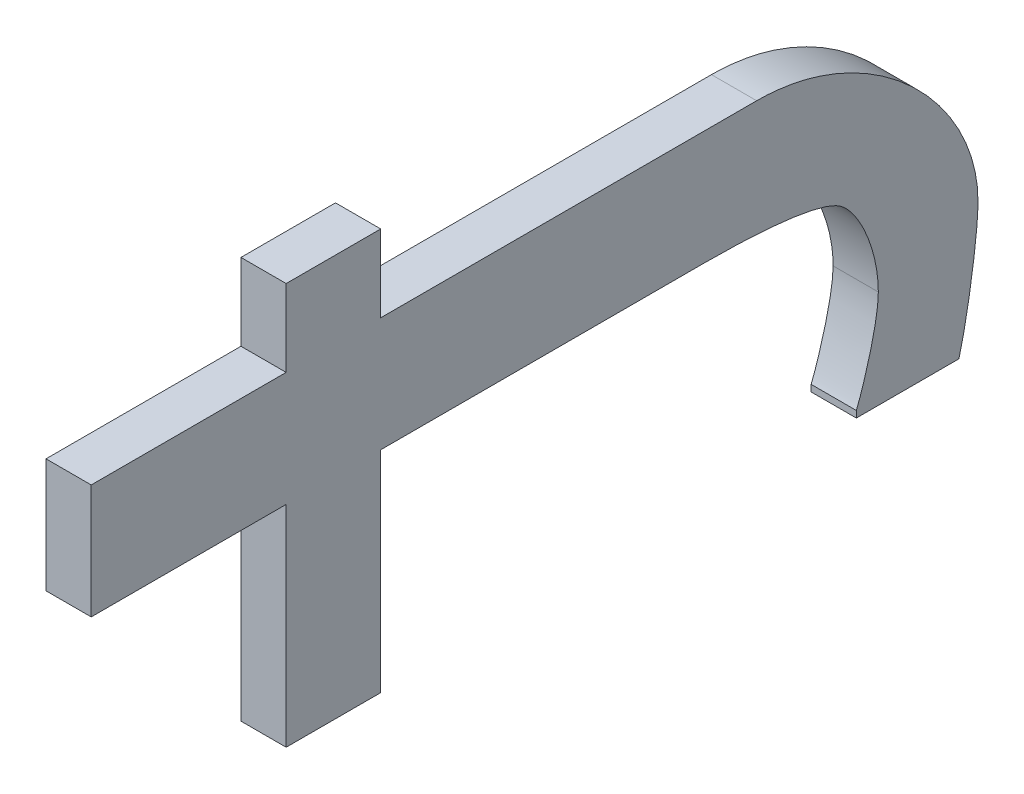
ISO-10303-21;
HEADER;
FILE_DESCRIPTION(('STEP AP214'),'2;1');
FILE_NAME('part.step','',(''),(''),'','','');
FILE_SCHEMA(('AUTOMOTIVE_DESIGN { 1 0 10303 214 1 1 1 1 }'));
ENDSEC;
DATA;
#1=APPLICATION_CONTEXT('core data for automotive mechanical design processes');
#2=APPLICATION_PROTOCOL_DEFINITION('international standard','automotive_design',2000,#1);
#3=PRODUCT_CONTEXT('',#1,'mechanical');
#4=PRODUCT('Part','Part','',(#3));
#5=PRODUCT_RELATED_PRODUCT_CATEGORY('part','',(#4));
#6=PRODUCT_DEFINITION_FORMATION('','',#4);
#7=PRODUCT_DEFINITION_CONTEXT('part definition',#1,'design');
#8=PRODUCT_DEFINITION('design','',#6,#7);
#9=PRODUCT_DEFINITION_SHAPE('','',#8);
#10=(LENGTH_UNIT() NAMED_UNIT(*) SI_UNIT(.MILLI.,.METRE.));
#11=(NAMED_UNIT(*) PLANE_ANGLE_UNIT() SI_UNIT($,.RADIAN.));
#12=(NAMED_UNIT(*) SI_UNIT($,.STERADIAN.) SOLID_ANGLE_UNIT());
#13=UNCERTAINTY_MEASURE_WITH_UNIT(LENGTH_MEASURE(1.E-05),#10,'distance_accuracy_value','');
#14=(GEOMETRIC_REPRESENTATION_CONTEXT(3) GLOBAL_UNCERTAINTY_ASSIGNED_CONTEXT((#13)) GLOBAL_UNIT_ASSIGNED_CONTEXT((#10,
#11,#12)) REPRESENTATION_CONTEXT('',''));
#15=CARTESIAN_POINT('',(0.,0.,0.));
#16=DIRECTION('',(0.,0.,1.));
#17=DIRECTION('',(1.,0.,0.));
#18=AXIS2_PLACEMENT_3D('',#15,#16,#17);
#19=CARTESIAN_POINT('',(-14.0348633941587,1.58473913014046,-0.050000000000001));
#20=DIRECTION('',(-1.,0.,0.));
#21=DIRECTION('',(0.,0.,1.));
#22=AXIS2_PLACEMENT_3D('',#19,#20,#21);
#23=PLANE('',#22);
#24=CARTESIAN_POINT('',(-14.0348633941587,1.95433767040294,-6.42248660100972));
#25=CARTESIAN_POINT('',(-14.0348633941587,1.97076863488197,-6.42248425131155));
#26=CARTESIAN_POINT('',(-14.0348633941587,1.98712230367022,-6.42099098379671));
#27=CARTESIAN_POINT('',(-14.0348633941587,2.01927458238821,-6.41549078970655));
#28=CARTESIAN_POINT('',(-14.0348633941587,2.035076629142,-6.41150444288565));
#29=CARTESIAN_POINT('',(-14.0348633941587,2.07290323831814,-6.39923257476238));
#30=CARTESIAN_POINT('',(-14.0348633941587,2.09455704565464,-6.38982231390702));
#31=CARTESIAN_POINT('',(-14.0348633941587,2.13618180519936,-6.36767421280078));
#32=CARTESIAN_POINT('',(-14.0348633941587,2.15614317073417,-6.35491890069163));
#33=CARTESIAN_POINT('',(-14.0348633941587,2.19990595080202,-6.32249859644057));
#34=CARTESIAN_POINT('',(-14.0348633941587,2.22302538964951,-6.30191232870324));
#35=CARTESIAN_POINT('',(-14.0348633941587,2.26559105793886,-6.25726301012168));
#36=CARTESIAN_POINT('',(-14.0348633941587,2.28503643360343,-6.23319915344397));
#37=CARTESIAN_POINT('',(-14.0348633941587,2.31992548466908,-6.18199243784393));
#38=CARTESIAN_POINT('',(-14.0348633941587,2.33533119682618,-6.15482359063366));
#39=CARTESIAN_POINT('',(-14.0348633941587,2.36109455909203,-6.09824915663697));
#40=CARTESIAN_POINT('',(-14.0348633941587,2.37146879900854,-6.06885129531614));
#41=CARTESIAN_POINT('',(-14.0348633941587,2.3873665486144,-6.00422144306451));
#42=CARTESIAN_POINT('',(-14.0348633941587,2.39196122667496,-5.96876413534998));
#43=CARTESIAN_POINT('',(-14.0348633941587,2.39193897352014,-5.93302143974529));
#44=B_SPLINE_CURVE_WITH_KNOTS('',3,(#24,#25,#26,#27,#28,#29,#30,#31,#32,#33,#34,#35,#36,#37,#38,
#39,#40,#41,#42,#43),.UNSPECIFIED.,.F.,.F.,(4,2,2,2,2,2,2,2,2,4),(0.,0.0491113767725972,
0.0978226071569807,0.168275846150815,0.239104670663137,0.33150468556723,0.423926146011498,
0.51718731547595,0.610138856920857,0.716655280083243),.UNSPECIFIED.);
#45=CARTESIAN_POINT('',(-14.0348633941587,1.95433767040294,-6.42248660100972));
#46=VERTEX_POINT('',#45);
#47=CARTESIAN_POINT('',(-14.0348633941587,2.3919389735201,-5.93302143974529));
#48=VERTEX_POINT('',#47);
#49=EDGE_CURVE('E382',#46,#48,#44,.T.);
#50=ORIENTED_EDGE('',*,*,#49,.T.);
#51=DIRECTION('',(0.,0.,-1.));
#52=VECTOR('',#51,1.);
#53=CARTESIAN_POINT('',(-14.0348633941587,2.39193897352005,-5.10157896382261));
#54=LINE('',#53,#52);
#55=CARTESIAN_POINT('',(-14.0348633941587,2.39193897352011,-5.10157896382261));
#56=VERTEX_POINT('',#55);
#57=EDGE_CURVE('E290',#48,#56,#54,.F.);
#58=ORIENTED_EDGE('',*,*,#57,.T.);
#59=DIRECTION('',(0.,1.,0.));
#60=VECTOR('',#59,1.);
#61=CARTESIAN_POINT('',(-14.0348633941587,2.56211725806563,-5.10157896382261));
#62=LINE('',#61,#60);
#63=CARTESIAN_POINT('',(-14.0348633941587,2.56211725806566,-5.10157896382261));
#64=VERTEX_POINT('',#63);
#65=EDGE_CURVE('E283',#56,#64,#62,.T.);
#66=ORIENTED_EDGE('',*,*,#65,.T.);
#67=DIRECTION('',(0.,0.,-1.));
#68=VECTOR('',#67,1.);
#69=CARTESIAN_POINT('',(-14.0348633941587,2.56211725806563,-4.89250278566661));
#70=LINE('',#69,#68);
#71=CARTESIAN_POINT('',(-14.0348633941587,2.56211725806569,-4.89250278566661));
#72=VERTEX_POINT('',#71);
#73=EDGE_CURVE('E269',#64,#72,#70,.F.);
#74=ORIENTED_EDGE('',*,*,#73,.T.);
#75=DIRECTION('',(0.,1.,0.));
#76=VECTOR('',#75,1.);
#77=CARTESIAN_POINT('',(-14.0348633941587,2.39193897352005,-4.89250278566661));
#78=LINE('',#77,#76);
#79=CARTESIAN_POINT('',(-14.0348633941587,2.39193897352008,-4.89250278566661));
#80=VERTEX_POINT('',#79);
#81=EDGE_CURVE('E255',#72,#80,#78,.F.);
#82=ORIENTED_EDGE('',*,*,#81,.T.);
#83=DIRECTION('',(0.,0.,-1.));
#84=VECTOR('',#83,1.);
#85=CARTESIAN_POINT('',(-14.0348633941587,2.39193897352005,-4.46138446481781));
#86=LINE('',#85,#84);
#87=CARTESIAN_POINT('',(-14.0348633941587,2.39193897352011,-4.46138446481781));
#88=VERTEX_POINT('',#87);
#89=EDGE_CURVE('E241',#80,#88,#86,.F.);
#90=ORIENTED_EDGE('',*,*,#89,.T.);
#91=DIRECTION('',(0.,1.,0.));
#92=VECTOR('',#91,1.);
#93=CARTESIAN_POINT('',(-14.0348633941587,2.13910266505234,-4.46138446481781));
#94=LINE('',#93,#92);
#95=CARTESIAN_POINT('',(-14.0348633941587,2.13910266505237,-4.46138446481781));
#96=VERTEX_POINT('',#95);
#97=EDGE_CURVE('E227',#88,#96,#94,.F.);
#98=ORIENTED_EDGE('',*,*,#97,.T.);
#99=DIRECTION('',(0.,0.,1.));
#100=VECTOR('',#99,1.);
#101=CARTESIAN_POINT('',(-14.0348633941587,2.13910266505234,-4.89250278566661));
#102=LINE('',#101,#100);
#103=CARTESIAN_POINT('',(-14.0348633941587,2.13910266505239,-4.89250278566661));
#104=VERTEX_POINT('',#103);
#105=EDGE_CURVE('E213',#96,#104,#102,.F.);
#106=ORIENTED_EDGE('',*,*,#105,.T.);
#107=DIRECTION('',(0.,1.,0.));
#108=VECTOR('',#107,1.);
#109=CARTESIAN_POINT('',(-14.0348633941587,1.67394868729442,-4.89250278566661));
#110=LINE('',#109,#108);
#111=CARTESIAN_POINT('',(-14.0348633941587,1.67394868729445,-4.89250278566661));
#112=VERTEX_POINT('',#111);
#113=EDGE_CURVE('E199',#104,#112,#110,.F.);
#114=ORIENTED_EDGE('',*,*,#113,.T.);
#115=DIRECTION('',(0.,0.,1.));
#116=VECTOR('',#115,1.);
#117=CARTESIAN_POINT('',(-14.0348633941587,1.67394868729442,-5.10157896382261));
#118=LINE('',#117,#116);
#119=CARTESIAN_POINT('',(-14.0348633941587,1.67394868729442,-5.10157896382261));
#120=VERTEX_POINT('',#119);
#121=EDGE_CURVE('E186',#112,#120,#118,.F.);
#122=ORIENTED_EDGE('',*,*,#121,.T.);
#123=DIRECTION('',(0.,1.,0.));
#124=VECTOR('',#123,1.);
#125=CARTESIAN_POINT('',(-14.0348633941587,2.13910266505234,-5.10157896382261));
#126=LINE('',#125,#124);
#127=CARTESIAN_POINT('',(-14.0348633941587,2.13910266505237,-5.10157896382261));
#128=VERTEX_POINT('',#127);
#129=EDGE_CURVE('E174',#120,#128,#126,.T.);
#130=ORIENTED_EDGE('',*,*,#129,.T.);
#131=DIRECTION('',(0.,0.,1.));
#132=VECTOR('',#131,1.);
#133=CARTESIAN_POINT('',(-14.0348633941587,2.13910266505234,-5.81632775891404));
#134=LINE('',#133,#132);
#135=CARTESIAN_POINT('',(-14.0348633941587,2.13910266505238,-5.81632775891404));
#136=VERTEX_POINT('',#135);
#137=EDGE_CURVE('E146',#128,#136,#134,.F.);
#138=ORIENTED_EDGE('',*,*,#137,.T.);
#139=CARTESIAN_POINT('',(-14.0348633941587,2.13910266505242,-5.81632775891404));
#140=CARTESIAN_POINT('',(-14.0348633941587,2.13909358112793,-5.83296080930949));
#141=CARTESIAN_POINT('',(-14.0348633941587,2.13892739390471,-5.84959658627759));
#142=CARTESIAN_POINT('',(-14.0348633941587,2.13818095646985,-5.88293502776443));
#143=CARTESIAN_POINT('',(-14.0348633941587,2.13759880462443,-5.89963764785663));
#144=CARTESIAN_POINT('',(-14.0348633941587,2.13594774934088,-5.93244352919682));
#145=CARTESIAN_POINT('',(-14.0348633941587,2.1348962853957,-5.94854763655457));
#146=CARTESIAN_POINT('',(-14.0348633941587,2.13214075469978,-5.98065862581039));
#147=CARTESIAN_POINT('',(-14.0348633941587,2.13043857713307,-5.9966656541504));
#148=CARTESIAN_POINT('',(-14.0348633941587,2.12709835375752,-6.02074604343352));
#149=CARTESIAN_POINT('',(-14.0348633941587,2.12583613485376,-6.02887057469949));
#150=CARTESIAN_POINT('',(-14.0348633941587,2.12295200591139,-6.04504517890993));
#151=CARTESIAN_POINT('',(-14.0348633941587,2.12133059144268,-6.05309533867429));
#152=CARTESIAN_POINT('',(-14.0348633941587,2.11756071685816,-6.06913687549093));
#153=CARTESIAN_POINT('',(-14.0348633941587,2.11540873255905,-6.07712747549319));
#154=CARTESIAN_POINT('',(-14.0348633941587,2.11154465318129,-6.08893044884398));
#155=CARTESIAN_POINT('',(-14.0348633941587,2.11014676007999,-6.09284284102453));
#156=CARTESIAN_POINT('',(-14.0348633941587,2.10704695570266,-6.10055398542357));
#157=CARTESIAN_POINT('',(-14.0348633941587,2.10534437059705,-6.10435246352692));
#158=CARTESIAN_POINT('',(-14.0348633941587,2.1034462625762,-6.10806196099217));
#159=B_SPLINE_CURVE_WITH_KNOTS('',3,(#139,#140,#141,#142,#143,#144,#145,#146,#147,#148,#149,
#150,#151,#152,#153,#154,#155,#156,#157,#158),.UNSPECIFIED.,.F.,.F.,(4,2,2,2,2,2,2,2,2,4),(0.,
0.0499027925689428,0.100035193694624,0.148442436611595,0.196710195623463,0.221370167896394,
0.245996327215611,0.270790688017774,0.283243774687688,0.295724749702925),.UNSPECIFIED.);
#160=CARTESIAN_POINT('',(-14.0348633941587,2.1034462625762,-6.10806196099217));
#161=VERTEX_POINT('',#160);
#162=EDGE_CURVE('E23',#136,#161,#159,.T.);
#163=ORIENTED_EDGE('',*,*,#162,.T.);
#164=CARTESIAN_POINT('',(-14.0348633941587,2.1034462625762,-6.10806196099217));
#165=CARTESIAN_POINT('',(-14.0348633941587,2.10126418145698,-6.11249942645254));
#166=CARTESIAN_POINT('',(-14.0348633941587,2.09860441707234,-6.11663455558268));
#167=CARTESIAN_POINT('',(-14.0348633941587,2.09266292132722,-6.12434931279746));
#168=CARTESIAN_POINT('',(-14.0348633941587,2.08939045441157,-6.12793592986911));
#169=CARTESIAN_POINT('',(-14.0348633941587,2.07940801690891,-6.1377372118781));
#170=CARTESIAN_POINT('',(-14.0348633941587,2.07222790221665,-6.14345442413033));
#171=CARTESIAN_POINT('',(-14.0348633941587,2.05712264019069,-6.15396469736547));
#172=CARTESIAN_POINT('',(-14.0348633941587,2.04918941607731,-6.15874552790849));
#173=CARTESIAN_POINT('',(-14.0348633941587,2.02481045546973,-6.17187700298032));
#174=CARTESIAN_POINT('',(-14.0348633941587,2.00773459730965,-6.17905813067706));
#175=CARTESIAN_POINT('',(-14.0348633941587,1.97280553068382,-6.1907173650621));
#176=CARTESIAN_POINT('',(-14.0348633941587,1.95495711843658,-6.1952101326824));
#177=CARTESIAN_POINT('',(-14.0348633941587,1.92930630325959,-6.1994099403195));
#178=CARTESIAN_POINT('',(-14.0348633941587,1.92170745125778,-6.20038027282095));
#179=CARTESIAN_POINT('',(-14.0348633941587,1.90645177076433,-6.2017056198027));
#180=CARTESIAN_POINT('',(-14.0348633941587,1.8987949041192,-6.20206018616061));
#181=CARTESIAN_POINT('',(-14.0348633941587,1.89112859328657,-6.20206520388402));
#182=B_SPLINE_CURVE_WITH_KNOTS('',3,(#164,#165,#166,#167,#168,#169,#170,#171,#172,#173,#174,
#175,#176,#177,#178,#179,#180,#181),.UNSPECIFIED.,.F.,.F.,(4,2,2,2,2,2,2,2,4),(0.,
0.014715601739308,0.0292244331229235,0.0566285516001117,0.0843697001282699,0.139658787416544,
0.194643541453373,0.217603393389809,0.240579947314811),.UNSPECIFIED.);
#183=CARTESIAN_POINT('',(-14.0348633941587,1.89112859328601,-6.20206520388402));
#184=VERTEX_POINT('',#183);
#185=EDGE_CURVE('E149',#161,#184,#182,.T.);
#186=ORIENTED_EDGE('',*,*,#185,.T.);
#187=CARTESIAN_POINT('',(-14.0348633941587,1.89112859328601,-6.20206520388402));
#188=CARTESIAN_POINT('',(-14.0348633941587,1.88560518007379,-6.2020430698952));
#189=CARTESIAN_POINT('',(-14.0348633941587,1.88009372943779,-6.20177082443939));
#190=CARTESIAN_POINT('',(-14.0348633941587,1.86910817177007,-6.20086306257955));
#191=CARTESIAN_POINT('',(-14.0348633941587,1.86363401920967,-6.20022812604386));
#192=CARTESIAN_POINT('',(-14.0348633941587,1.84728469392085,-6.19798564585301));
#193=CARTESIAN_POINT('',(-14.0348633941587,1.83645891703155,-6.1960391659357));
#194=CARTESIAN_POINT('',(-14.0348633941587,1.81405167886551,-6.19143534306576));
#195=CARTESIAN_POINT('',(-14.0348633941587,1.80247985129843,-6.18873326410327));
#196=CARTESIAN_POINT('',(-14.0348633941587,1.77943525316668,-6.18288510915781));
#197=CARTESIAN_POINT('',(-14.0348633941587,1.76796262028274,-6.17973849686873));
#198=CARTESIAN_POINT('',(-14.0348633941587,1.7450420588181,-6.17305219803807));
#199=CARTESIAN_POINT('',(-14.0348633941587,1.73359490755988,-6.16950983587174));
#200=CARTESIAN_POINT('',(-14.0348633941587,1.71654743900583,-6.1638656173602));
#201=CARTESIAN_POINT('',(-14.0348633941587,1.71089159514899,-6.16193138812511));
#202=CARTESIAN_POINT('',(-14.0348633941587,1.7024503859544,-6.15890614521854));
#203=CARTESIAN_POINT('',(-14.0348633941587,1.69964327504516,-6.15787689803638));
#204=CARTESIAN_POINT('',(-14.0348633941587,1.69406079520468,-6.15573392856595));
#205=CARTESIAN_POINT('',(-14.0348633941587,1.69128543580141,-6.15462018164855));
#206=CARTESIAN_POINT('',(-14.0348633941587,1.68853539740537,-6.15344283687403));
#207=B_SPLINE_CURVE_WITH_KNOTS('',3,(#187,#188,#189,#190,#191,#192,#193,#194,#195,#196,#197,
#198,#199,#200,#201,#202,#203,#204,#205,#206),.UNSPECIFIED.,.F.,.F.,(4,2,2,2,2,2,2,2,2,4),(0.,
0.0165489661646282,0.0330715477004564,0.0660457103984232,0.101684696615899,0.137367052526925,
0.173307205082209,0.191238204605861,0.200206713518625,0.209177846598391),.UNSPECIFIED.);
#208=CARTESIAN_POINT('',(-14.0348633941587,1.68853539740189,-6.15344283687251));
#209=VERTEX_POINT('',#208);
#210=EDGE_CURVE('E370',#184,#209,#207,.T.);
#211=ORIENTED_EDGE('',*,*,#210,.T.);
#212=DIRECTION('',(0.,1.,0.));
#213=VECTOR('',#212,1.);
#214=CARTESIAN_POINT('',(-14.0348633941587,1.67394868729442,-6.15344283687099));
#215=LINE('',#214,#213);
#216=CARTESIAN_POINT('',(-14.0348633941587,1.67394868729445,-6.15344283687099));
#217=VERTEX_POINT('',#216);
#218=EDGE_CURVE('E301',#209,#217,#215,.F.);
#219=ORIENTED_EDGE('',*,*,#218,.T.);
#220=DIRECTION('',(0.,0.,1.));
#221=VECTOR('',#220,1.);
#222=CARTESIAN_POINT('',(-14.0348633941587,1.67394868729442,-6.3803472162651));
#223=LINE('',#222,#221);
#224=CARTESIAN_POINT('',(-14.0348633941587,1.67394868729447,-6.3803472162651));
#225=VERTEX_POINT('',#224);
#226=EDGE_CURVE('E295',#217,#225,#223,.F.);
#227=ORIENTED_EDGE('',*,*,#226,.T.);
#228=CARTESIAN_POINT('',(-14.0348633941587,1.67394868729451,-6.3803472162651));
#229=CARTESIAN_POINT('',(-14.0348633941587,1.68201021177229,-6.38252529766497));
#230=CARTESIAN_POINT('',(-14.0348633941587,1.69011158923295,-6.38454364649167));
#231=CARTESIAN_POINT('',(-14.0348633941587,1.7063674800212,-6.38834516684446));
#232=CARTESIAN_POINT('',(-14.0348633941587,1.71452197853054,-6.39012840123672));
#233=CARTESIAN_POINT('',(-14.0348633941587,1.73903870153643,-6.39525481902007));
#234=CARTESIAN_POINT('',(-14.0348633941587,1.75544734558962,-6.39837303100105));
#235=CARTESIAN_POINT('',(-14.0348633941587,1.786948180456,-6.4039308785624));
#236=CARTESIAN_POINT('',(-14.0348633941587,1.80203429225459,-6.40640560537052));
#237=CARTESIAN_POINT('',(-14.0348633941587,1.83225743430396,-6.41100390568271));
#238=CARTESIAN_POINT('',(-14.0348633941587,1.84739445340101,-6.41312755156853));
#239=CARTESIAN_POINT('',(-14.0348633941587,1.87017412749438,-6.41599648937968));
#240=CARTESIAN_POINT('',(-14.0348633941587,1.87779662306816,-6.41690169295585));
#241=CARTESIAN_POINT('',(-14.0348633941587,1.89305523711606,-6.4185746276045));
#242=CARTESIAN_POINT('',(-14.0348633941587,1.90069135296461,-6.4193423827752));
#243=CARTESIAN_POINT('',(-14.0348633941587,1.91598361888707,-6.42070445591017));
#244=CARTESIAN_POINT('',(-14.0348633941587,1.92363977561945,-6.42129870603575));
#245=CARTESIAN_POINT('',(-14.0348633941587,1.93897364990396,-6.42216843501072));
#246=CARTESIAN_POINT('',(-14.0348633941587,1.94665137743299,-6.42244372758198));
#247=CARTESIAN_POINT('',(-14.0348633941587,1.95433767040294,-6.42248660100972));
#248=B_SPLINE_CURVE_WITH_KNOTS('',3,(#228,#229,#230,#231,#232,#233,#234,#235,#236,#237,#238,
#239,#240,#241,#242,#243,#244,#245,#246,#247),.UNSPECIFIED.,.F.,.F.,(4,2,2,2,2,2,2,2,2,4),(0.,
0.0250454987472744,0.050084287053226,0.1001828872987,0.14604274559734,0.191893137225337,
0.214920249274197,0.237943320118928,0.260975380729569,0.284020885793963),.UNSPECIFIED.);
#249=EDGE_CURVE('E388',#225,#46,#248,.T.);
#250=ORIENTED_EDGE('',*,*,#249,.T.);
#251=EDGE_LOOP('',(#50,#58,#66,#74,#82,#90,#98,#106,#114,#122,#130,#138,#163,#186,#211,#219,
#227,#250));
#252=FACE_BOUND('',#251,.T.);
#253=ADVANCED_FACE('F16',(#252),#23,.F.);
#254=CARTESIAN_POINT('',(-39.7858458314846,2.13910266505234,-5.10157896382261));
#255=DIRECTION('',(0.,0.,1.));
#256=DIRECTION('',(1.,0.,0.));
#257=AXIS2_PLACEMENT_3D('',#254,#255,#256);
#258=PLANE('',#257);
#259=DIRECTION('',(1.,0.,0.));
#260=VECTOR('',#259,1.);
#261=CARTESIAN_POINT('',(-39.7858458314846,2.13910266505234,-5.10157896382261));
#262=LINE('',#261,#260);
#263=CARTESIAN_POINT('',(-14.1348633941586,2.13910266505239,-5.10157896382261));
#264=VERTEX_POINT('',#263);
#265=EDGE_CURVE('E171',#264,#128,#262,.T.);
#266=ORIENTED_EDGE('',*,*,#265,.T.);
#267=ORIENTED_EDGE('',*,*,#129,.F.);
#268=DIRECTION('',(1.,0.,0.));
#269=VECTOR('',#268,1.);
#270=CARTESIAN_POINT('',(-39.7858458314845,1.67394868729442,-5.10157896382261));
#271=LINE('',#270,#269);
#272=CARTESIAN_POINT('',(-14.1348633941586,1.67394868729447,-5.10157896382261));
#273=VERTEX_POINT('',#272);
#274=EDGE_CURVE('E181',#120,#273,#271,.F.);
#275=ORIENTED_EDGE('',*,*,#274,.T.);
#276=DIRECTION('',(0.,1.,0.));
#277=VECTOR('',#276,1.);
#278=CARTESIAN_POINT('',(-14.1348633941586,1.58473913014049,-5.10157896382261));
#279=LINE('',#278,#277);
#280=EDGE_CURVE('E177',#273,#264,#279,.T.);
#281=ORIENTED_EDGE('',*,*,#280,.T.);
#282=EDGE_LOOP('',(#266,#267,#275,#281));
#283=FACE_BOUND('',#282,.T.);
#284=ADVANCED_FACE('F378',(#283),#258,.F.);
#285=CARTESIAN_POINT('',(-39.7858458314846,2.13910266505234,-5.81632775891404));
#286=DIRECTION('',(0.,1.,0.));
#287=DIRECTION('',(0.,0.,1.));
#288=AXIS2_PLACEMENT_3D('',#285,#286,#287);
#289=PLANE('',#288);
#290=DIRECTION('',(1.,0.,0.));
#291=VECTOR('',#290,1.);
#292=CARTESIAN_POINT('',(-14.0848633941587,2.13910266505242,-5.81632775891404));
#293=LINE('',#292,#291);
#294=CARTESIAN_POINT('',(-14.1348633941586,2.13910266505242,-5.81632775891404));
#295=VERTEX_POINT('',#294);
#296=EDGE_CURVE('E155',#295,#136,#293,.T.);
#297=ORIENTED_EDGE('',*,*,#296,.T.);
#298=ORIENTED_EDGE('',*,*,#137,.F.);
#299=ORIENTED_EDGE('',*,*,#265,.F.);
#300=DIRECTION('',(0.,0.,-1.));
#301=VECTOR('',#300,1.);
#302=CARTESIAN_POINT('',(-14.1348633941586,2.13910266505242,0.));
#303=LINE('',#302,#301);
#304=EDGE_CURVE('E180',#264,#295,#303,.T.);
#305=ORIENTED_EDGE('',*,*,#304,.T.);
#306=EDGE_LOOP('',(#297,#298,#299,#305));
#307=FACE_BOUND('',#306,.T.);
#308=ADVANCED_FACE('F502',(#307),#289,.F.);
#309=CARTESIAN_POINT('',(-14.1348633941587,2.1034462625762,-6.10806196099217));
#310=CARTESIAN_POINT('',(-14.0348633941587,2.1034462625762,-6.10806196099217));
#311=CARTESIAN_POINT('',(-14.1348633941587,2.13099893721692,-6.05457735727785));
#312=CARTESIAN_POINT('',(-14.0348633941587,2.13099893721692,-6.05457735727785));
#313=CARTESIAN_POINT('',(-14.1348633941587,2.13910266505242,-5.92977994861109));
#314=CARTESIAN_POINT('',(-14.0348633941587,2.13910266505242,-5.92977994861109));
#315=CARTESIAN_POINT('',(-14.1348633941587,2.13910266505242,-5.81632775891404));
#316=CARTESIAN_POINT('',(-14.0348633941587,2.13910266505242,-5.81632775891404));
#317=B_SPLINE_SURFACE_WITH_KNOTS('',3,1,((#309,#310),(#311,#312),(#313,#314),(#315,#316)),
.UNSPECIFIED.,.F.,.F.,.F.,(4,4),(2,2),(0.,1.),(0.,0.01),.UNSPECIFIED.);
#318=DIRECTION('',(1.,0.,0.));
#319=VECTOR('',#318,1.);
#320=CARTESIAN_POINT('',(-14.0848633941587,2.1034462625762,-6.10806196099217));
#321=LINE('',#320,#319);
#322=CARTESIAN_POINT('',(-14.1348633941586,2.1034462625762,-6.10806196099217));
#323=VERTEX_POINT('',#322);
#324=EDGE_CURVE('E154',#323,#161,#321,.T.);
#325=CARTESIAN_POINT('',(-14.1348633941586,2.13910266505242,-5.81632775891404));
#326=CARTESIAN_POINT('',(-14.1348633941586,2.13909358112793,-5.83296080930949));
#327=CARTESIAN_POINT('',(-14.1348633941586,2.13892739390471,-5.84959658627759));
#328=CARTESIAN_POINT('',(-14.1348633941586,2.13818095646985,-5.88293502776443));
#329=CARTESIAN_POINT('',(-14.1348633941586,2.13759880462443,-5.89963764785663));
#330=CARTESIAN_POINT('',(-14.1348633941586,2.13594774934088,-5.93244352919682));
#331=CARTESIAN_POINT('',(-14.1348633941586,2.13489628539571,-5.94854763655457));
#332=CARTESIAN_POINT('',(-14.1348633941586,2.13214075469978,-5.98065862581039));
#333=CARTESIAN_POINT('',(-14.1348633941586,2.13043857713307,-5.9966656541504));
#334=CARTESIAN_POINT('',(-14.1348633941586,2.12709835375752,-6.02074604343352));
#335=CARTESIAN_POINT('',(-14.1348633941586,2.12583613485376,-6.02887057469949));
#336=CARTESIAN_POINT('',(-14.1348633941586,2.12295200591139,-6.04504517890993));
#337=CARTESIAN_POINT('',(-14.1348633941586,2.12133059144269,-6.05309533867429));
#338=CARTESIAN_POINT('',(-14.1348633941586,2.11756071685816,-6.06913687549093));
#339=CARTESIAN_POINT('',(-14.1348633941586,2.11540873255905,-6.07712747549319));
#340=CARTESIAN_POINT('',(-14.1348633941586,2.11154465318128,-6.08893044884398));
#341=CARTESIAN_POINT('',(-14.1348633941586,2.11014676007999,-6.09284284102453));
#342=CARTESIAN_POINT('',(-14.1348633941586,2.10704695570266,-6.10055398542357));
#343=CARTESIAN_POINT('',(-14.1348633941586,2.10534437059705,-6.10435246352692));
#344=CARTESIAN_POINT('',(-14.1348633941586,2.1034462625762,-6.10806196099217));
#345=B_SPLINE_CURVE_WITH_KNOTS('',3,(#325,#326,#327,#328,#329,#330,#331,#332,#333,#334,#335,
#336,#337,#338,#339,#340,#341,#342,#343,#344),.UNSPECIFIED.,.F.,.F.,(4,2,2,2,2,2,2,2,2,4),(0.,
0.0499027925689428,0.100035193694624,0.148442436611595,0.196710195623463,0.221370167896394,
0.245996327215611,0.270790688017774,0.283243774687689,0.295724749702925),.UNSPECIFIED.);
#346=EDGE_CURVE('E165',#295,#323,#345,.T.);
#347=ORIENTED_EDGE('',*,*,#324,.T.);
#348=ORIENTED_EDGE('',*,*,#162,.F.);
#349=ORIENTED_EDGE('',*,*,#296,.F.);
#350=ORIENTED_EDGE('',*,*,#346,.T.);
#351=EDGE_LOOP('',(#347,#348,#349,#350));
#352=FACE_BOUND('',#351,.T.);
#353=ADVANCED_FACE('F163',(#352),#317,.F.);
#354=CARTESIAN_POINT('',(-14.1348633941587,1.89112859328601,-6.20206520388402));
#355=CARTESIAN_POINT('',(-14.0348633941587,1.89112859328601,-6.20206520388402));
#356=CARTESIAN_POINT('',(-14.1348633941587,1.97864885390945,-6.20206520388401));
#357=CARTESIAN_POINT('',(-14.0348633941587,1.97864885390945,-6.20206520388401));
#358=CARTESIAN_POINT('',(-14.1348633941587,2.08075582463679,-6.15506358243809));
#359=CARTESIAN_POINT('',(-14.0348633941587,2.08075582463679,-6.15506358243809));
#360=CARTESIAN_POINT('',(-14.1348633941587,2.1034462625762,-6.10806196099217));
#361=CARTESIAN_POINT('',(-14.0348633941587,2.1034462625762,-6.10806196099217));
#362=B_SPLINE_SURFACE_WITH_KNOTS('',3,1,((#354,#355),(#356,#357),(#358,#359),(#360,#361)),
.UNSPECIFIED.,.F.,.F.,.F.,(4,4),(2,2),(0.,1.),(0.,0.01),.UNSPECIFIED.);
#363=DIRECTION('',(1.,0.,0.));
#364=VECTOR('',#363,1.);
#365=CARTESIAN_POINT('',(-14.0848633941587,1.89112859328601,-6.20206520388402));
#366=LINE('',#365,#364);
#367=CARTESIAN_POINT('',(-14.1348633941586,1.89112859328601,-6.20206520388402));
#368=VERTEX_POINT('',#367);
#369=EDGE_CURVE('E161',#368,#184,#366,.T.);
#370=CARTESIAN_POINT('',(-14.1348633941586,2.1034462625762,-6.10806196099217));
#371=CARTESIAN_POINT('',(-14.1348633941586,2.10126418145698,-6.11249942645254));
#372=CARTESIAN_POINT('',(-14.1348633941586,2.09860441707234,-6.11663455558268));
#373=CARTESIAN_POINT('',(-14.1348633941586,2.09266292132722,-6.12434931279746));
#374=CARTESIAN_POINT('',(-14.1348633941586,2.08939045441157,-6.12793592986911));
#375=CARTESIAN_POINT('',(-14.1348633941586,2.07940801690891,-6.1377372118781));
#376=CARTESIAN_POINT('',(-14.1348633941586,2.07222790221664,-6.14345442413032));
#377=CARTESIAN_POINT('',(-14.1348633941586,2.05712264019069,-6.15396469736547));
#378=CARTESIAN_POINT('',(-14.1348633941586,2.04918941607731,-6.1587455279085));
#379=CARTESIAN_POINT('',(-14.1348633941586,2.02481045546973,-6.17187700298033));
#380=CARTESIAN_POINT('',(-14.1348633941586,2.00773459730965,-6.17905813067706));
#381=CARTESIAN_POINT('',(-14.1348633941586,1.97280553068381,-6.1907173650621));
#382=CARTESIAN_POINT('',(-14.1348633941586,1.95495711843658,-6.1952101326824));
#383=CARTESIAN_POINT('',(-14.1348633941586,1.92930630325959,-6.1994099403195));
#384=CARTESIAN_POINT('',(-14.1348633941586,1.92170745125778,-6.20038027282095));
#385=CARTESIAN_POINT('',(-14.1348633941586,1.90645177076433,-6.2017056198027));
#386=CARTESIAN_POINT('',(-14.1348633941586,1.8987949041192,-6.20206018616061));
#387=CARTESIAN_POINT('',(-14.1348633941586,1.89112859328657,-6.20206520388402));
#388=B_SPLINE_CURVE_WITH_KNOTS('',3,(#370,#371,#372,#373,#374,#375,#376,#377,#378,#379,#380,
#381,#382,#383,#384,#385,#386,#387),.UNSPECIFIED.,.F.,.F.,(4,2,2,2,2,2,2,2,4),(0.,
0.0147156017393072,0.0292244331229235,0.0566285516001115,0.0843697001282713,0.139658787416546,
0.194643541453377,0.217603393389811,0.240579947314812),.UNSPECIFIED.);
#389=EDGE_CURVE('E340',#323,#368,#388,.T.);
#390=ORIENTED_EDGE('',*,*,#369,.T.);
#391=ORIENTED_EDGE('',*,*,#185,.F.);
#392=ORIENTED_EDGE('',*,*,#324,.F.);
#393=ORIENTED_EDGE('',*,*,#389,.T.);
#394=EDGE_LOOP('',(#390,#391,#392,#393));
#395=FACE_BOUND('',#394,.T.);
#396=ADVANCED_FACE('F158',(#395),#362,.F.);
#397=CARTESIAN_POINT('',(-14.1348633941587,1.68853539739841,-6.15344283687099));
#398=CARTESIAN_POINT('',(-14.0348633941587,1.68853539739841,-6.15344283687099));
#399=CARTESIAN_POINT('',(-14.1348633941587,1.71446732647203,-6.1647880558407));
#400=CARTESIAN_POINT('',(-14.0348633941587,1.71446732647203,-6.1647880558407));
#401=CARTESIAN_POINT('',(-14.1348633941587,1.82954026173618,-6.20206520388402));
#402=CARTESIAN_POINT('',(-14.0348633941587,1.82954026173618,-6.20206520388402));
#403=CARTESIAN_POINT('',(-14.1348633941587,1.89112859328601,-6.20206520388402));
#404=CARTESIAN_POINT('',(-14.0348633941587,1.89112859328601,-6.20206520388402));
#405=B_SPLINE_SURFACE_WITH_KNOTS('',3,1,((#397,#398),(#399,#400),(#401,#402),(#403,#404)),
.UNSPECIFIED.,.F.,.F.,.F.,(4,4),(2,2),(0.,1.),(0.,0.01),.UNSPECIFIED.);
#406=DIRECTION('',(-1.,0.,0.));
#407=VECTOR('',#406,1.);
#408=CARTESIAN_POINT('',(-39.7858458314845,1.68853539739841,-6.15344283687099));
#409=LINE('',#408,#407);
#410=CARTESIAN_POINT('',(-14.1348633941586,1.68853539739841,-6.15344283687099));
#411=VERTEX_POINT('',#410);
#412=EDGE_CURVE('E303',#411,#209,#409,.F.);
#413=CARTESIAN_POINT('',(-14.1348633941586,1.89112859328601,-6.20206520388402));
#414=CARTESIAN_POINT('',(-14.1348633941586,1.88560518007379,-6.2020430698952));
#415=CARTESIAN_POINT('',(-14.1348633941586,1.88009372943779,-6.20177082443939));
#416=CARTESIAN_POINT('',(-14.1348633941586,1.86910817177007,-6.20086306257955));
#417=CARTESIAN_POINT('',(-14.1348633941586,1.86363401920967,-6.20022812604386));
#418=CARTESIAN_POINT('',(-14.1348633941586,1.84728469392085,-6.19798564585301));
#419=CARTESIAN_POINT('',(-14.1348633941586,1.83645891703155,-6.1960391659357));
#420=CARTESIAN_POINT('',(-14.1348633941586,1.81405167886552,-6.19143534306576));
#421=CARTESIAN_POINT('',(-14.1348633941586,1.80247985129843,-6.18873326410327));
#422=CARTESIAN_POINT('',(-14.1348633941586,1.77943525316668,-6.18288510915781));
#423=CARTESIAN_POINT('',(-14.1348633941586,1.76796262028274,-6.17973849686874));
#424=CARTESIAN_POINT('',(-14.1348633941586,1.7450420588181,-6.17305219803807));
#425=CARTESIAN_POINT('',(-14.1348633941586,1.73359490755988,-6.16950983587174));
#426=CARTESIAN_POINT('',(-14.1348633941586,1.71654743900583,-6.1638656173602));
#427=CARTESIAN_POINT('',(-14.1348633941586,1.710891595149,-6.16193138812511));
#428=CARTESIAN_POINT('',(-14.1348633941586,1.70245038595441,-6.15890614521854));
#429=CARTESIAN_POINT('',(-14.1348633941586,1.69964327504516,-6.15787689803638));
#430=CARTESIAN_POINT('',(-14.1348633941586,1.69406079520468,-6.15573392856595));
#431=CARTESIAN_POINT('',(-14.1348633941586,1.69128543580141,-6.15462018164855));
#432=CARTESIAN_POINT('',(-14.1348633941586,1.68853539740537,-6.15344283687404));
#433=B_SPLINE_CURVE_WITH_KNOTS('',3,(#413,#414,#415,#416,#417,#418,#419,#420,#421,#422,#423,
#424,#425,#426,#427,#428,#429,#430,#431,#432),.UNSPECIFIED.,.F.,.F.,(4,2,2,2,2,2,2,2,2,4),(0.,
0.0165489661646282,0.0330715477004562,0.0660457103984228,0.101684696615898,0.137367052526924,
0.173307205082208,0.19123820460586,0.200206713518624,0.20917784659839),.UNSPECIFIED.);
#434=EDGE_CURVE('E334',#368,#411,#433,.T.);
#435=ORIENTED_EDGE('',*,*,#412,.T.);
#436=ORIENTED_EDGE('',*,*,#210,.F.);
#437=ORIENTED_EDGE('',*,*,#369,.F.);
#438=ORIENTED_EDGE('',*,*,#434,.T.);
#439=EDGE_LOOP('',(#435,#436,#437,#438));
#440=FACE_BOUND('',#439,.T.);
#441=ADVANCED_FACE('F353',(#440),#405,.F.);
#442=CARTESIAN_POINT('',(-39.7858458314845,1.67394868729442,-6.15344283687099));
#443=DIRECTION('',(0.,0.,-1.));
#444=DIRECTION('',(-1.,0.,0.));
#445=AXIS2_PLACEMENT_3D('',#442,#443,#444);
#446=PLANE('',#445);
#447=DIRECTION('',(1.,0.,0.));
#448=VECTOR('',#447,1.);
#449=CARTESIAN_POINT('',(-39.7858458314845,1.67394868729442,-6.15344283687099));
#450=LINE('',#449,#448);
#451=CARTESIAN_POINT('',(-14.1348633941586,1.67394868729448,-6.15344283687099));
#452=VERTEX_POINT('',#451);
#453=EDGE_CURVE('E298',#452,#217,#450,.T.);
#454=ORIENTED_EDGE('',*,*,#453,.T.);
#455=ORIENTED_EDGE('',*,*,#218,.F.);
#456=ORIENTED_EDGE('',*,*,#412,.F.);
#457=DIRECTION('',(0.,1.,0.));
#458=VECTOR('',#457,1.);
#459=CARTESIAN_POINT('',(-14.1348633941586,1.58473913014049,-6.15344283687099));
#460=LINE('',#459,#458);
#461=EDGE_CURVE('E440',#411,#452,#460,.F.);
#462=ORIENTED_EDGE('',*,*,#461,.T.);
#463=EDGE_LOOP('',(#454,#455,#456,#462));
#464=FACE_BOUND('',#463,.T.);
#465=ADVANCED_FACE('F413',(#464),#446,.F.);
#466=CARTESIAN_POINT('',(-39.7858458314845,1.67394868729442,-6.3803472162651));
#467=DIRECTION('',(0.,1.,0.));
#468=DIRECTION('',(0.,0.,1.));
#469=AXIS2_PLACEMENT_3D('',#466,#467,#468);
#470=PLANE('',#469);
#471=DIRECTION('',(1.,0.,0.));
#472=VECTOR('',#471,1.);
#473=CARTESIAN_POINT('',(-14.0848633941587,1.67394868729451,-6.3803472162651));
#474=LINE('',#473,#472);
#475=CARTESIAN_POINT('',(-14.1348633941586,1.67394868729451,-6.3803472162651));
#476=VERTEX_POINT('',#475);
#477=EDGE_CURVE('E297',#476,#225,#474,.T.);
#478=ORIENTED_EDGE('',*,*,#477,.T.);
#479=ORIENTED_EDGE('',*,*,#226,.F.);
#480=ORIENTED_EDGE('',*,*,#453,.F.);
#481=DIRECTION('',(0.,0.,-1.));
#482=VECTOR('',#481,1.);
#483=CARTESIAN_POINT('',(-14.1348633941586,1.67394868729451,0.));
#484=LINE('',#483,#482);
#485=EDGE_CURVE('E443',#452,#476,#484,.T.);
#486=ORIENTED_EDGE('',*,*,#485,.T.);
#487=EDGE_LOOP('',(#478,#479,#480,#486));
#488=FACE_BOUND('',#487,.T.);
#489=ADVANCED_FACE('F398',(#488),#470,.F.);
#490=CARTESIAN_POINT('',(-14.1348633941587,1.95433767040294,-6.42248660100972));
#491=CARTESIAN_POINT('',(-14.0348633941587,1.95433767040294,-6.42248660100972));
#492=CARTESIAN_POINT('',(-14.1348633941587,1.89112859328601,-6.42248660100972));
#493=CARTESIAN_POINT('',(-14.0348633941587,1.89112859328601,-6.42248660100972));
#494=CARTESIAN_POINT('',(-14.1348633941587,1.74526149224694,-6.39979616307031));
#495=CARTESIAN_POINT('',(-14.0348633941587,1.74526149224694,-6.39979616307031));
#496=CARTESIAN_POINT('',(-14.1348633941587,1.67394868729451,-6.3803472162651));
#497=CARTESIAN_POINT('',(-14.0348633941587,1.67394868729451,-6.3803472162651));
#498=B_SPLINE_SURFACE_WITH_KNOTS('',3,1,((#490,#491),(#492,#493),(#494,#495),(#496,#497)),
.UNSPECIFIED.,.F.,.F.,.F.,(4,4),(2,2),(0.,1.),(0.,0.01),.UNSPECIFIED.);
#499=DIRECTION('',(1.,0.,0.));
#500=VECTOR('',#499,1.);
#501=CARTESIAN_POINT('',(-14.0848633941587,1.95433767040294,-6.42248660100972));
#502=LINE('',#501,#500);
#503=CARTESIAN_POINT('',(-14.1348633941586,1.95433767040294,-6.42248660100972));
#504=VERTEX_POINT('',#503);
#505=EDGE_CURVE('E392',#504,#46,#502,.T.);
#506=CARTESIAN_POINT('',(-14.1348633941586,1.67394868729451,-6.3803472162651));
#507=CARTESIAN_POINT('',(-14.1348633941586,1.68201021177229,-6.38252529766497));
#508=CARTESIAN_POINT('',(-14.1348633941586,1.69011158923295,-6.38454364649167));
#509=CARTESIAN_POINT('',(-14.1348633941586,1.7063674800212,-6.38834516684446));
#510=CARTESIAN_POINT('',(-14.1348633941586,1.71452197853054,-6.39012840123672));
#511=CARTESIAN_POINT('',(-14.1348633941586,1.73903870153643,-6.39525481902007));
#512=CARTESIAN_POINT('',(-14.1348633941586,1.75544734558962,-6.39837303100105));
#513=CARTESIAN_POINT('',(-14.1348633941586,1.786948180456,-6.4039308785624));
#514=CARTESIAN_POINT('',(-14.1348633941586,1.80203429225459,-6.40640560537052));
#515=CARTESIAN_POINT('',(-14.1348633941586,1.83225743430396,-6.41100390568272));
#516=CARTESIAN_POINT('',(-14.1348633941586,1.84739445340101,-6.41312755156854));
#517=CARTESIAN_POINT('',(-14.1348633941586,1.87017412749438,-6.41599648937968));
#518=CARTESIAN_POINT('',(-14.1348633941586,1.87779662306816,-6.41690169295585));
#519=CARTESIAN_POINT('',(-14.1348633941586,1.89305523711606,-6.4185746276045));
#520=CARTESIAN_POINT('',(-14.1348633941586,1.90069135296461,-6.4193423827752));
#521=CARTESIAN_POINT('',(-14.1348633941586,1.91598361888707,-6.42070445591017));
#522=CARTESIAN_POINT('',(-14.1348633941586,1.92363977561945,-6.42129870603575));
#523=CARTESIAN_POINT('',(-14.1348633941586,1.93897364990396,-6.42216843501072));
#524=CARTESIAN_POINT('',(-14.1348633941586,1.94665137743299,-6.42244372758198));
#525=CARTESIAN_POINT('',(-14.1348633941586,1.95433767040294,-6.42248660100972));
#526=B_SPLINE_CURVE_WITH_KNOTS('',3,(#506,#507,#508,#509,#510,#511,#512,#513,#514,#515,#516,
#517,#518,#519,#520,#521,#522,#523,#524,#525),.UNSPECIFIED.,.F.,.F.,(4,2,2,2,2,2,2,2,2,4),(0.,
0.0250454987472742,0.0500842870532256,0.100182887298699,0.146042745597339,0.191893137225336,
0.214920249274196,0.237943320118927,0.260975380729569,0.284020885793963),.UNSPECIFIED.);
#527=EDGE_CURVE('E317',#476,#504,#526,.T.);
#528=ORIENTED_EDGE('',*,*,#505,.T.);
#529=ORIENTED_EDGE('',*,*,#249,.F.);
#530=ORIENTED_EDGE('',*,*,#477,.F.);
#531=ORIENTED_EDGE('',*,*,#527,.T.);
#532=EDGE_LOOP('',(#528,#529,#530,#531));
#533=FACE_BOUND('',#532,.T.);
#534=ADVANCED_FACE('F393',(#533),#498,.F.);
#535=CARTESIAN_POINT('',(-14.1348633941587,2.39193897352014,-5.93302143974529));
#536=CARTESIAN_POINT('',(-14.0348633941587,2.39193897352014,-5.93302143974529));
#537=CARTESIAN_POINT('',(-14.1348633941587,2.39193897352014,-6.18747849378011));
#538=CARTESIAN_POINT('',(-14.0348633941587,2.39193897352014,-6.18747849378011));
#539=CARTESIAN_POINT('',(-14.1348633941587,2.16017235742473,-6.42248660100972));
#540=CARTESIAN_POINT('',(-14.0348633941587,2.16017235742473,-6.42248660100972));
#541=CARTESIAN_POINT('',(-14.1348633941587,1.95433767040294,-6.42248660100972));
#542=CARTESIAN_POINT('',(-14.0348633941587,1.95433767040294,-6.42248660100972));
#543=B_SPLINE_SURFACE_WITH_KNOTS('',3,1,((#535,#536),(#537,#538),(#539,#540),(#541,#542)),
.UNSPECIFIED.,.F.,.F.,.F.,(4,4),(2,2),(0.,1.),(0.,0.01),.UNSPECIFIED.);
#544=DIRECTION('',(1.,0.,0.));
#545=VECTOR('',#544,1.);
#546=CARTESIAN_POINT('',(-39.7858458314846,2.39193897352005,-5.93302143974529));
#547=LINE('',#546,#545);
#548=CARTESIAN_POINT('',(-14.1348633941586,2.3919389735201,-5.93302143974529));
#549=VERTEX_POINT('',#548);
#550=EDGE_CURVE('E292',#549,#48,#547,.T.);
#551=CARTESIAN_POINT('',(-14.1348633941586,1.95433767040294,-6.42248660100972));
#552=CARTESIAN_POINT('',(-14.1348633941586,1.97076863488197,-6.42248425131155));
#553=CARTESIAN_POINT('',(-14.1348633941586,1.98712230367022,-6.42099098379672));
#554=CARTESIAN_POINT('',(-14.1348633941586,2.01927458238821,-6.41549078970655));
#555=CARTESIAN_POINT('',(-14.1348633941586,2.035076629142,-6.41150444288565));
#556=CARTESIAN_POINT('',(-14.1348633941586,2.07290323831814,-6.39923257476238));
#557=CARTESIAN_POINT('',(-14.1348633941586,2.09455704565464,-6.38982231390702));
#558=CARTESIAN_POINT('',(-14.1348633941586,2.13618180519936,-6.36767421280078));
#559=CARTESIAN_POINT('',(-14.1348633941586,2.15614317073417,-6.35491890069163));
#560=CARTESIAN_POINT('',(-14.1348633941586,2.19990595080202,-6.32249859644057));
#561=CARTESIAN_POINT('',(-14.1348633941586,2.22302538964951,-6.30191232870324));
#562=CARTESIAN_POINT('',(-14.1348633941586,2.26559105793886,-6.25726301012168));
#563=CARTESIAN_POINT('',(-14.1348633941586,2.28503643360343,-6.23319915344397));
#564=CARTESIAN_POINT('',(-14.1348633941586,2.31992548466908,-6.18199243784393));
#565=CARTESIAN_POINT('',(-14.1348633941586,2.33533119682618,-6.15482359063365));
#566=CARTESIAN_POINT('',(-14.1348633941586,2.36109455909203,-6.09824915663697));
#567=CARTESIAN_POINT('',(-14.1348633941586,2.37146879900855,-6.06885129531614));
#568=CARTESIAN_POINT('',(-14.1348633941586,2.3873665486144,-6.00422144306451));
#569=CARTESIAN_POINT('',(-14.1348633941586,2.39196122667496,-5.96876413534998));
#570=CARTESIAN_POINT('',(-14.1348633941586,2.39193897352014,-5.93302143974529));
#571=B_SPLINE_CURVE_WITH_KNOTS('',3,(#551,#552,#553,#554,#555,#556,#557,#558,#559,#560,#561,
#562,#563,#564,#565,#566,#567,#568,#569,#570),.UNSPECIFIED.,.F.,.F.,(4,2,2,2,2,2,2,2,2,4),(0.,
0.0491113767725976,0.0978226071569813,0.168275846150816,0.239104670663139,0.331504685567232,
0.423926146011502,0.517187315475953,0.610138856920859,0.716655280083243),.UNSPECIFIED.);
#572=EDGE_CURVE('E309',#504,#549,#571,.T.);
#573=ORIENTED_EDGE('',*,*,#550,.T.);
#574=ORIENTED_EDGE('',*,*,#49,.F.);
#575=ORIENTED_EDGE('',*,*,#505,.F.);
#576=ORIENTED_EDGE('',*,*,#572,.T.);
#577=EDGE_LOOP('',(#573,#574,#575,#576));
#578=FACE_BOUND('',#577,.T.);
#579=ADVANCED_FACE('F18',(#578),#543,.F.);
#580=CARTESIAN_POINT('',(-39.7858458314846,2.39193897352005,-5.10157896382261));
#581=DIRECTION('',(0.,-1.,0.));
#582=DIRECTION('',(0.,0.,-1.));
#583=AXIS2_PLACEMENT_3D('',#580,#581,#582);
#584=PLANE('',#583);
#585=DIRECTION('',(1.,0.,0.));
#586=VECTOR('',#585,1.);
#587=CARTESIAN_POINT('',(-39.7858458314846,2.39193897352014,-5.10157896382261));
#588=LINE('',#587,#586);
#589=CARTESIAN_POINT('',(-14.1348633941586,2.39193897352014,-5.10157896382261));
#590=VERTEX_POINT('',#589);
#591=EDGE_CURVE('E287',#590,#56,#588,.T.);
#592=ORIENTED_EDGE('',*,*,#591,.T.);
#593=ORIENTED_EDGE('',*,*,#57,.F.);
#594=ORIENTED_EDGE('',*,*,#550,.F.);
#595=DIRECTION('',(0.,0.,-1.));
#596=VECTOR('',#595,1.);
#597=CARTESIAN_POINT('',(-14.1348633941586,2.39193897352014,0.));
#598=LINE('',#597,#596);
#599=EDGE_CURVE('E316',#549,#590,#598,.F.);
#600=ORIENTED_EDGE('',*,*,#599,.T.);
#601=EDGE_LOOP('',(#592,#593,#594,#600));
#602=FACE_BOUND('',#601,.T.);
#603=ADVANCED_FACE('F411',(#602),#584,.F.);
#604=CARTESIAN_POINT('',(-39.7858458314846,2.56211725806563,-5.10157896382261));
#605=DIRECTION('',(0.,0.,1.));
#606=DIRECTION('',(1.,0.,0.));
#607=AXIS2_PLACEMENT_3D('',#604,#605,#606);
#608=PLANE('',#607);
#609=DIRECTION('',(1.,0.,0.));
#610=VECTOR('',#609,1.);
#611=CARTESIAN_POINT('',(-39.7858458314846,2.56211725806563,-5.10157896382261));
#612=LINE('',#611,#610);
#613=CARTESIAN_POINT('',(-14.1348633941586,2.56211725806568,-5.10157896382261));
#614=VERTEX_POINT('',#613);
#615=EDGE_CURVE('E273',#614,#64,#612,.T.);
#616=ORIENTED_EDGE('',*,*,#615,.T.);
#617=ORIENTED_EDGE('',*,*,#65,.F.);
#618=ORIENTED_EDGE('',*,*,#591,.F.);
#619=DIRECTION('',(0.,1.,0.));
#620=VECTOR('',#619,1.);
#621=CARTESIAN_POINT('',(-14.1348633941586,1.58473913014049,-5.10157896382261));
#622=LINE('',#621,#620);
#623=EDGE_CURVE('E278',#590,#614,#622,.T.);
#624=ORIENTED_EDGE('',*,*,#623,.T.);
#625=EDGE_LOOP('',(#616,#617,#618,#624));
#626=FACE_BOUND('',#625,.T.);
#627=ADVANCED_FACE('F473',(#626),#608,.F.);
#628=CARTESIAN_POINT('',(-39.7858458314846,2.56211725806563,-4.89250278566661));
#629=DIRECTION('',(0.,-1.,0.));
#630=DIRECTION('',(0.,0.,-1.));
#631=AXIS2_PLACEMENT_3D('',#628,#629,#630);
#632=PLANE('',#631);
#633=DIRECTION('',(-1.,0.,0.));
#634=VECTOR('',#633,1.);
#635=CARTESIAN_POINT('',(-39.7858458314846,2.56211725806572,-4.89250278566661));
#636=LINE('',#635,#634);
#637=CARTESIAN_POINT('',(-14.1348633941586,2.5621172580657,-4.89250278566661));
#638=VERTEX_POINT('',#637);
#639=EDGE_CURVE('E259',#638,#72,#636,.F.);
#640=ORIENTED_EDGE('',*,*,#639,.T.);
#641=ORIENTED_EDGE('',*,*,#73,.F.);
#642=ORIENTED_EDGE('',*,*,#615,.F.);
#643=DIRECTION('',(0.,0.,-1.));
#644=VECTOR('',#643,1.);
#645=CARTESIAN_POINT('',(-14.1348633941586,2.56211725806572,0.));
#646=LINE('',#645,#644);
#647=EDGE_CURVE('E264',#614,#638,#646,.F.);
#648=ORIENTED_EDGE('',*,*,#647,.T.);
#649=EDGE_LOOP('',(#640,#641,#642,#648));
#650=FACE_BOUND('',#649,.T.);
#651=ADVANCED_FACE('F478',(#650),#632,.F.);
#652=CARTESIAN_POINT('',(-39.7858458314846,2.39193897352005,-4.89250278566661));
#653=DIRECTION('',(0.,0.,-1.));
#654=DIRECTION('',(-1.,0.,0.));
#655=AXIS2_PLACEMENT_3D('',#652,#653,#654);
#656=PLANE('',#655);
#657=DIRECTION('',(1.,0.,0.));
#658=VECTOR('',#657,1.);
#659=CARTESIAN_POINT('',(-39.7858458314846,2.39193897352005,-4.89250278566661));
#660=LINE('',#659,#658);
#661=CARTESIAN_POINT('',(-14.1348633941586,2.3919389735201,-4.89250278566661));
#662=VERTEX_POINT('',#661);
#663=EDGE_CURVE('E245',#662,#80,#660,.T.);
#664=ORIENTED_EDGE('',*,*,#663,.T.);
#665=ORIENTED_EDGE('',*,*,#81,.F.);
#666=ORIENTED_EDGE('',*,*,#639,.F.);
#667=DIRECTION('',(0.,1.,0.));
#668=VECTOR('',#667,1.);
#669=CARTESIAN_POINT('',(-14.1348633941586,1.58473913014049,-4.89250278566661));
#670=LINE('',#669,#668);
#671=EDGE_CURVE('E250',#638,#662,#670,.F.);
#672=ORIENTED_EDGE('',*,*,#671,.T.);
#673=EDGE_LOOP('',(#664,#665,#666,#672));
#674=FACE_BOUND('',#673,.T.);
#675=ADVANCED_FACE('F483',(#674),#656,.F.);
#676=CARTESIAN_POINT('',(-39.7858458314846,2.39193897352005,-4.46138446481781));
#677=DIRECTION('',(0.,-1.,0.));
#678=DIRECTION('',(0.,0.,-1.));
#679=AXIS2_PLACEMENT_3D('',#676,#677,#678);
#680=PLANE('',#679);
#681=DIRECTION('',(-1.,0.,0.));
#682=VECTOR('',#681,1.);
#683=CARTESIAN_POINT('',(-39.7858458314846,2.39193897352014,-4.46138446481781));
#684=LINE('',#683,#682);
#685=CARTESIAN_POINT('',(-14.1348633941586,2.39193897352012,-4.46138446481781));
#686=VERTEX_POINT('',#685);
#687=EDGE_CURVE('E231',#686,#88,#684,.F.);
#688=ORIENTED_EDGE('',*,*,#687,.T.);
#689=ORIENTED_EDGE('',*,*,#89,.F.);
#690=ORIENTED_EDGE('',*,*,#663,.F.);
#691=DIRECTION('',(0.,0.,-1.));
#692=VECTOR('',#691,1.);
#693=CARTESIAN_POINT('',(-14.1348633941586,2.39193897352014,0.));
#694=LINE('',#693,#692);
#695=EDGE_CURVE('E236',#662,#686,#694,.F.);
#696=ORIENTED_EDGE('',*,*,#695,.T.);
#697=EDGE_LOOP('',(#688,#689,#690,#696));
#698=FACE_BOUND('',#697,.T.);
#699=ADVANCED_FACE('F485',(#698),#680,.F.);
#700=CARTESIAN_POINT('',(-39.7858458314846,2.13910266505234,-4.46138446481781));
#701=DIRECTION('',(0.,0.,-1.));
#702=DIRECTION('',(-1.,0.,0.));
#703=AXIS2_PLACEMENT_3D('',#700,#701,#702);
#704=PLANE('',#703);
#705=DIRECTION('',(1.,0.,0.));
#706=VECTOR('',#705,1.);
#707=CARTESIAN_POINT('',(-39.7858458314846,2.13910266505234,-4.46138446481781));
#708=LINE('',#707,#706);
#709=CARTESIAN_POINT('',(-14.1348633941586,2.13910266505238,-4.46138446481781));
#710=VERTEX_POINT('',#709);
#711=EDGE_CURVE('E217',#710,#96,#708,.T.);
#712=ORIENTED_EDGE('',*,*,#711,.T.);
#713=ORIENTED_EDGE('',*,*,#97,.F.);
#714=ORIENTED_EDGE('',*,*,#687,.F.);
#715=DIRECTION('',(0.,1.,0.));
#716=VECTOR('',#715,1.);
#717=CARTESIAN_POINT('',(-14.1348633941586,1.58473913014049,-4.46138446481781));
#718=LINE('',#717,#716);
#719=EDGE_CURVE('E222',#686,#710,#718,.F.);
#720=ORIENTED_EDGE('',*,*,#719,.T.);
#721=EDGE_LOOP('',(#712,#713,#714,#720));
#722=FACE_BOUND('',#721,.T.);
#723=ADVANCED_FACE('F489',(#722),#704,.F.);
#724=CARTESIAN_POINT('',(-39.7858458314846,2.13910266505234,-4.89250278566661));
#725=DIRECTION('',(0.,1.,0.));
#726=DIRECTION('',(0.,0.,1.));
#727=AXIS2_PLACEMENT_3D('',#724,#725,#726);
#728=PLANE('',#727);
#729=DIRECTION('',(-1.,0.,0.));
#730=VECTOR('',#729,1.);
#731=CARTESIAN_POINT('',(-39.7858458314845,2.13910266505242,-4.89250278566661));
#732=LINE('',#731,#730);
#733=CARTESIAN_POINT('',(-14.1348633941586,2.1391026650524,-4.89250278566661));
#734=VERTEX_POINT('',#733);
#735=EDGE_CURVE('E203',#734,#104,#732,.F.);
#736=ORIENTED_EDGE('',*,*,#735,.T.);
#737=ORIENTED_EDGE('',*,*,#105,.F.);
#738=ORIENTED_EDGE('',*,*,#711,.F.);
#739=DIRECTION('',(0.,0.,-1.));
#740=VECTOR('',#739,1.);
#741=CARTESIAN_POINT('',(-14.1348633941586,2.13910266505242,0.));
#742=LINE('',#741,#740);
#743=EDGE_CURVE('E208',#710,#734,#742,.T.);
#744=ORIENTED_EDGE('',*,*,#743,.T.);
#745=EDGE_LOOP('',(#736,#737,#738,#744));
#746=FACE_BOUND('',#745,.T.);
#747=ADVANCED_FACE('F494',(#746),#728,.F.);
#748=CARTESIAN_POINT('',(-39.7858458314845,1.67394868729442,-4.89250278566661));
#749=DIRECTION('',(0.,0.,-1.));
#750=DIRECTION('',(-1.,0.,0.));
#751=AXIS2_PLACEMENT_3D('',#748,#749,#750);
#752=PLANE('',#751);
#753=DIRECTION('',(1.,0.,0.));
#754=VECTOR('',#753,1.);
#755=CARTESIAN_POINT('',(-39.7858458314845,1.67394868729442,-4.89250278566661));
#756=LINE('',#755,#754);
#757=CARTESIAN_POINT('',(-14.1348633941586,1.67394868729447,-4.89250278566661));
#758=VERTEX_POINT('',#757);
#759=EDGE_CURVE('E42',#758,#112,#756,.T.);
#760=ORIENTED_EDGE('',*,*,#759,.T.);
#761=ORIENTED_EDGE('',*,*,#113,.F.);
#762=ORIENTED_EDGE('',*,*,#735,.F.);
#763=DIRECTION('',(0.,1.,0.));
#764=VECTOR('',#763,1.);
#765=CARTESIAN_POINT('',(-14.1348633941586,1.58473913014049,-4.89250278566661));
#766=LINE('',#765,#764);
#767=EDGE_CURVE('E34',#734,#758,#766,.F.);
#768=ORIENTED_EDGE('',*,*,#767,.T.);
#769=EDGE_LOOP('',(#760,#761,#762,#768));
#770=FACE_BOUND('',#769,.T.);
#771=ADVANCED_FACE('F496',(#770),#752,.F.);
#772=CARTESIAN_POINT('',(-39.7858458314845,1.67394868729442,-5.10157896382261));
#773=DIRECTION('',(0.,1.,0.));
#774=DIRECTION('',(0.,0.,1.));
#775=AXIS2_PLACEMENT_3D('',#772,#773,#774);
#776=PLANE('',#775);
#777=ORIENTED_EDGE('',*,*,#274,.F.);
#778=ORIENTED_EDGE('',*,*,#121,.F.);
#779=ORIENTED_EDGE('',*,*,#759,.F.);
#780=DIRECTION('',(0.,0.,-1.));
#781=VECTOR('',#780,1.);
#782=CARTESIAN_POINT('',(-14.1348633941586,1.67394868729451,0.));
#783=LINE('',#782,#781);
#784=EDGE_CURVE('E10',#758,#273,#783,.T.);
#785=ORIENTED_EDGE('',*,*,#784,.T.);
#786=EDGE_LOOP('',(#777,#778,#779,#785));
#787=FACE_BOUND('',#786,.T.);
#788=ADVANCED_FACE('F326',(#787),#776,.F.);
#789=CARTESIAN_POINT('',(-14.1348633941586,1.58473913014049,0.));
#790=DIRECTION('',(1.,0.,0.));
#791=DIRECTION('',(0.,0.,-1.));
#792=AXIS2_PLACEMENT_3D('',#789,#790,#791);
#793=PLANE('',#792);
#794=ORIENTED_EDGE('',*,*,#767,.F.);
#795=ORIENTED_EDGE('',*,*,#743,.F.);
#796=ORIENTED_EDGE('',*,*,#719,.F.);
#797=ORIENTED_EDGE('',*,*,#695,.F.);
#798=ORIENTED_EDGE('',*,*,#671,.F.);
#799=ORIENTED_EDGE('',*,*,#647,.F.);
#800=ORIENTED_EDGE('',*,*,#623,.F.);
#801=ORIENTED_EDGE('',*,*,#599,.F.);
#802=ORIENTED_EDGE('',*,*,#572,.F.);
#803=ORIENTED_EDGE('',*,*,#527,.F.);
#804=ORIENTED_EDGE('',*,*,#485,.F.);
#805=ORIENTED_EDGE('',*,*,#461,.F.);
#806=ORIENTED_EDGE('',*,*,#434,.F.);
#807=ORIENTED_EDGE('',*,*,#389,.F.);
#808=ORIENTED_EDGE('',*,*,#346,.F.);
#809=ORIENTED_EDGE('',*,*,#304,.F.);
#810=ORIENTED_EDGE('',*,*,#280,.F.);
#811=ORIENTED_EDGE('',*,*,#784,.F.);
#812=EDGE_LOOP('',(#794,#795,#796,#797,#798,#799,#800,#801,#802,#803,#804,#805,#806,#807,#808,
#809,#810,#811));
#813=FACE_BOUND('',#812,.T.);
#814=ADVANCED_FACE('F322',(#813),#793,.F.);
#815=CLOSED_SHELL('',(#253,#284,#308,#353,#396,#441,#465,#489,#534,#579,#603,#627,#651,#675,
#699,#723,#747,#771,#788,#814));
#816=MANIFOLD_SOLID_BREP('B1',#815);
#817=ADVANCED_BREP_SHAPE_REPRESENTATION('',(#18,#816),#14);
#818=SHAPE_DEFINITION_REPRESENTATION(#9,#817);
ENDSEC;
END-ISO-10303-21;
